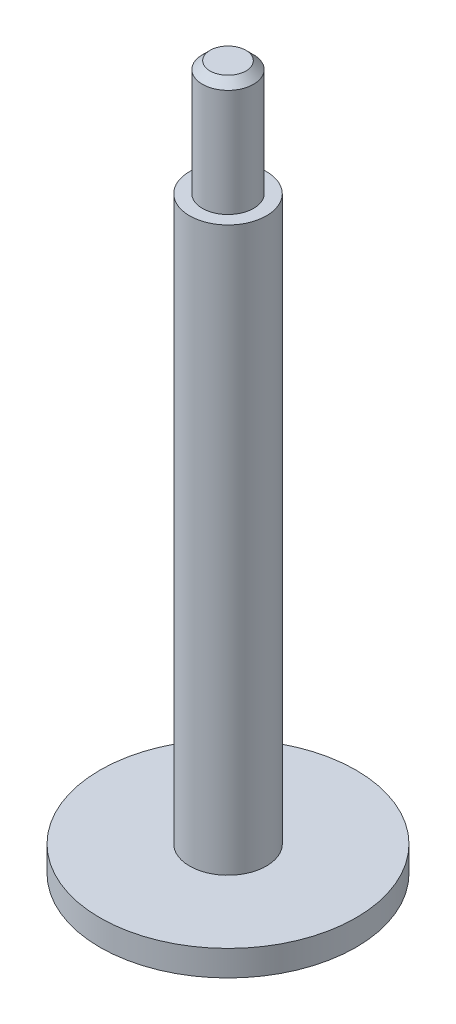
ISO-10303-21;
HEADER;
FILE_DESCRIPTION(('STEP AP214'),'2;1');
FILE_NAME('part.step','',(''),(''),'','','');
FILE_SCHEMA(('AUTOMOTIVE_DESIGN { 1 0 10303 214 1 1 1 1 }'));
ENDSEC;
DATA;
#1=APPLICATION_CONTEXT('core data for automotive mechanical design processes');
#2=APPLICATION_PROTOCOL_DEFINITION('international standard','automotive_design',2000,#1);
#3=PRODUCT_CONTEXT('',#1,'mechanical');
#4=PRODUCT('Part','Part','',(#3));
#5=PRODUCT_RELATED_PRODUCT_CATEGORY('part','',(#4));
#6=PRODUCT_DEFINITION_FORMATION('','',#4);
#7=PRODUCT_DEFINITION_CONTEXT('part definition',#1,'design');
#8=PRODUCT_DEFINITION('design','',#6,#7);
#9=PRODUCT_DEFINITION_SHAPE('','',#8);
#10=(LENGTH_UNIT() NAMED_UNIT(*) SI_UNIT(.MILLI.,.METRE.));
#11=(NAMED_UNIT(*) PLANE_ANGLE_UNIT() SI_UNIT($,.RADIAN.));
#12=(NAMED_UNIT(*) SI_UNIT($,.STERADIAN.) SOLID_ANGLE_UNIT());
#13=UNCERTAINTY_MEASURE_WITH_UNIT(LENGTH_MEASURE(1.E-05),#10,'distance_accuracy_value','');
#14=(GEOMETRIC_REPRESENTATION_CONTEXT(3) GLOBAL_UNCERTAINTY_ASSIGNED_CONTEXT((#13)) GLOBAL_UNIT_ASSIGNED_CONTEXT((#10,
#11,#12)) REPRESENTATION_CONTEXT('',''));
#15=CARTESIAN_POINT('',(0.,0.,0.));
#16=DIRECTION('',(0.,0.,1.));
#17=DIRECTION('',(1.,0.,0.));
#18=AXIS2_PLACEMENT_3D('',#15,#16,#17);
#19=CARTESIAN_POINT('',(-0.999999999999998,27.5,0.));
#20=DIRECTION('',(0.,1.,0.));
#21=DIRECTION('',(0.,0.,1.));
#22=AXIS2_PLACEMENT_3D('',#19,#20,#21);
#23=PLANE('',#22);
#24=CARTESIAN_POINT('',(0.,27.5,0.));
#25=DIRECTION('',(0.,1.,0.));
#26=DIRECTION('',(0.,0.,1.));
#27=AXIS2_PLACEMENT_3D('',#24,#25,#26);
#28=CIRCLE('',#27,0.699999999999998);
#29=CARTESIAN_POINT('',(0.,27.5,0.699999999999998));
#30=VERTEX_POINT('',#29);
#31=EDGE_CURVE('E39',#30,#30,#28,.T.);
#32=ORIENTED_EDGE('',*,*,#31,.T.);
#33=EDGE_LOOP('',(#32));
#34=FACE_BOUND('',#33,.T.);
#35=ADVANCED_FACE('F33',(#34),#23,.T.);
#36=CARTESIAN_POINT('',(0.,0.,0.));
#37=DIRECTION('',(0.,1.,0.));
#38=DIRECTION('',(0.,0.,1.));
#39=AXIS2_PLACEMENT_3D('',#36,#37,#38);
#40=CYLINDRICAL_SURFACE('',#39,0.999999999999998);
#41=CARTESIAN_POINT('',(0.,27.2,0.));
#42=DIRECTION('',(0.,1.,0.));
#43=DIRECTION('',(0.,0.,1.));
#44=AXIS2_PLACEMENT_3D('',#41,#42,#43);
#45=CIRCLE('',#44,0.999999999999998);
#46=CARTESIAN_POINT('',(0.,27.2,0.999999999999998));
#47=VERTEX_POINT('',#46);
#48=EDGE_CURVE('E10',#47,#47,#45,.F.);
#49=ORIENTED_EDGE('',*,*,#48,.T.);
#50=EDGE_LOOP('',(#49));
#51=FACE_BOUND('',#50,.T.);
#52=CARTESIAN_POINT('',(0.,23.,0.));
#53=DIRECTION('',(0.,1.,0.));
#54=DIRECTION('',(0.,0.,1.));
#55=AXIS2_PLACEMENT_3D('',#52,#53,#54);
#56=CIRCLE('',#55,0.999999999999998);
#57=CARTESIAN_POINT('',(0.,23.,0.999999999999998));
#58=VERTEX_POINT('',#57);
#59=EDGE_CURVE('E43',#58,#58,#56,.T.);
#60=ORIENTED_EDGE('',*,*,#59,.T.);
#61=EDGE_LOOP('',(#60));
#62=FACE_BOUND('',#61,.T.);
#63=ADVANCED_FACE('F78',(#51,#62),#40,.T.);
#64=CARTESIAN_POINT('',(-1.5,23.,0.));
#65=DIRECTION('',(0.,1.,0.));
#66=DIRECTION('',(0.,0.,1.));
#67=AXIS2_PLACEMENT_3D('',#64,#65,#66);
#68=PLANE('',#67);
#69=CARTESIAN_POINT('',(0.,23.,0.));
#70=DIRECTION('',(0.,1.,0.));
#71=DIRECTION('',(0.,0.,1.));
#72=AXIS2_PLACEMENT_3D('',#69,#70,#71);
#73=CIRCLE('',#72,1.5);
#74=CARTESIAN_POINT('',(0.,23.,1.5));
#75=VERTEX_POINT('',#74);
#76=EDGE_CURVE('E47',#75,#75,#73,.T.);
#77=ORIENTED_EDGE('',*,*,#76,.T.);
#78=EDGE_LOOP('',(#77));
#79=FACE_BOUND('',#78,.T.);
#80=ORIENTED_EDGE('',*,*,#59,.F.);
#81=EDGE_LOOP('',(#80));
#82=FACE_BOUND('',#81,.T.);
#83=ADVANCED_FACE('F82',(#79,#82),#68,.T.);
#84=CARTESIAN_POINT('',(0.,0.,0.));
#85=DIRECTION('',(0.,1.,0.));
#86=DIRECTION('',(0.,0.,1.));
#87=AXIS2_PLACEMENT_3D('',#84,#85,#86);
#88=CYLINDRICAL_SURFACE('',#87,1.5);
#89=CARTESIAN_POINT('',(0.,1.,0.));
#90=DIRECTION('',(0.,1.,0.));
#91=DIRECTION('',(0.,0.,1.));
#92=AXIS2_PLACEMENT_3D('',#89,#90,#91);
#93=CIRCLE('',#92,1.5);
#94=CARTESIAN_POINT('',(0.,1.,1.5));
#95=VERTEX_POINT('',#94);
#96=EDGE_CURVE('E52',#95,#95,#93,.T.);
#97=ORIENTED_EDGE('',*,*,#96,.T.);
#98=EDGE_LOOP('',(#97));
#99=FACE_BOUND('',#98,.T.);
#100=ORIENTED_EDGE('',*,*,#76,.F.);
#101=EDGE_LOOP('',(#100));
#102=FACE_BOUND('',#101,.T.);
#103=ADVANCED_FACE('F86',(#99,#102),#88,.T.);
#104=CARTESIAN_POINT('',(-4.99999999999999,1.,0.));
#105=DIRECTION('',(0.,1.,0.));
#106=DIRECTION('',(0.,0.,1.));
#107=AXIS2_PLACEMENT_3D('',#104,#105,#106);
#108=PLANE('',#107);
#109=CARTESIAN_POINT('',(0.,1.,0.));
#110=DIRECTION('',(0.,1.,0.));
#111=DIRECTION('',(0.,0.,1.));
#112=AXIS2_PLACEMENT_3D('',#109,#110,#111);
#113=CIRCLE('',#112,4.99999999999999);
#114=CARTESIAN_POINT('',(0.,1.,4.99999999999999));
#115=VERTEX_POINT('',#114);
#116=EDGE_CURVE('E55',#115,#115,#113,.T.);
#117=ORIENTED_EDGE('',*,*,#116,.T.);
#118=EDGE_LOOP('',(#117));
#119=FACE_BOUND('',#118,.T.);
#120=ORIENTED_EDGE('',*,*,#96,.F.);
#121=EDGE_LOOP('',(#120));
#122=FACE_BOUND('',#121,.T.);
#123=ADVANCED_FACE('F75',(#119,#122),#108,.T.);
#124=CARTESIAN_POINT('',(0.,0.,0.));
#125=DIRECTION('',(0.,1.,0.));
#126=DIRECTION('',(0.,0.,1.));
#127=AXIS2_PLACEMENT_3D('',#124,#125,#126);
#128=CYLINDRICAL_SURFACE('',#127,4.99999999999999);
#129=CARTESIAN_POINT('',(0.,0.,0.));
#130=DIRECTION('',(0.,1.,0.));
#131=DIRECTION('',(0.,0.,1.));
#132=AXIS2_PLACEMENT_3D('',#129,#130,#131);
#133=CIRCLE('',#132,4.99999999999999);
#134=CARTESIAN_POINT('',(0.,0.,4.99999999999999));
#135=VERTEX_POINT('',#134);
#136=EDGE_CURVE('E58',#135,#135,#133,.T.);
#137=ORIENTED_EDGE('',*,*,#136,.T.);
#138=EDGE_LOOP('',(#137));
#139=FACE_BOUND('',#138,.T.);
#140=ORIENTED_EDGE('',*,*,#116,.F.);
#141=EDGE_LOOP('',(#140));
#142=FACE_BOUND('',#141,.T.);
#143=ADVANCED_FACE('F62',(#139,#142),#128,.T.);
#144=CARTESIAN_POINT('',(0.,0.,0.));
#145=DIRECTION('',(0.,-1.,0.));
#146=DIRECTION('',(0.,0.,-1.));
#147=AXIS2_PLACEMENT_3D('',#144,#145,#146);
#148=PLANE('',#147);
#149=ORIENTED_EDGE('',*,*,#136,.F.);
#150=EDGE_LOOP('',(#149));
#151=FACE_BOUND('',#150,.T.);
#152=ADVANCED_FACE('F65',(#151),#148,.T.);
#153=CARTESIAN_POINT('',(0.,27.5,0.));
#154=DIRECTION('',(0.,-1.,0.));
#155=DIRECTION('',(0.,0.,-1.));
#156=AXIS2_PLACEMENT_3D('',#153,#154,#155);
#157=CONICAL_SURFACE('',#156,0.699999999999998,0.785398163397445);
#158=ORIENTED_EDGE('',*,*,#48,.F.);
#159=EDGE_LOOP('',(#158));
#160=FACE_BOUND('',#159,.T.);
#161=ORIENTED_EDGE('',*,*,#31,.F.);
#162=EDGE_LOOP('',(#161));
#163=FACE_BOUND('',#162,.T.);
#164=ADVANCED_FACE('F67',(#160,#163),#157,.T.);
#165=CLOSED_SHELL('',(#35,#63,#83,#103,#123,#143,#152,#164));
#166=MANIFOLD_SOLID_BREP('B2',#165);
#167=ADVANCED_BREP_SHAPE_REPRESENTATION('',(#18,#166),#14);
#168=SHAPE_DEFINITION_REPRESENTATION(#9,#167);
ENDSEC;
END-ISO-10303-21;
